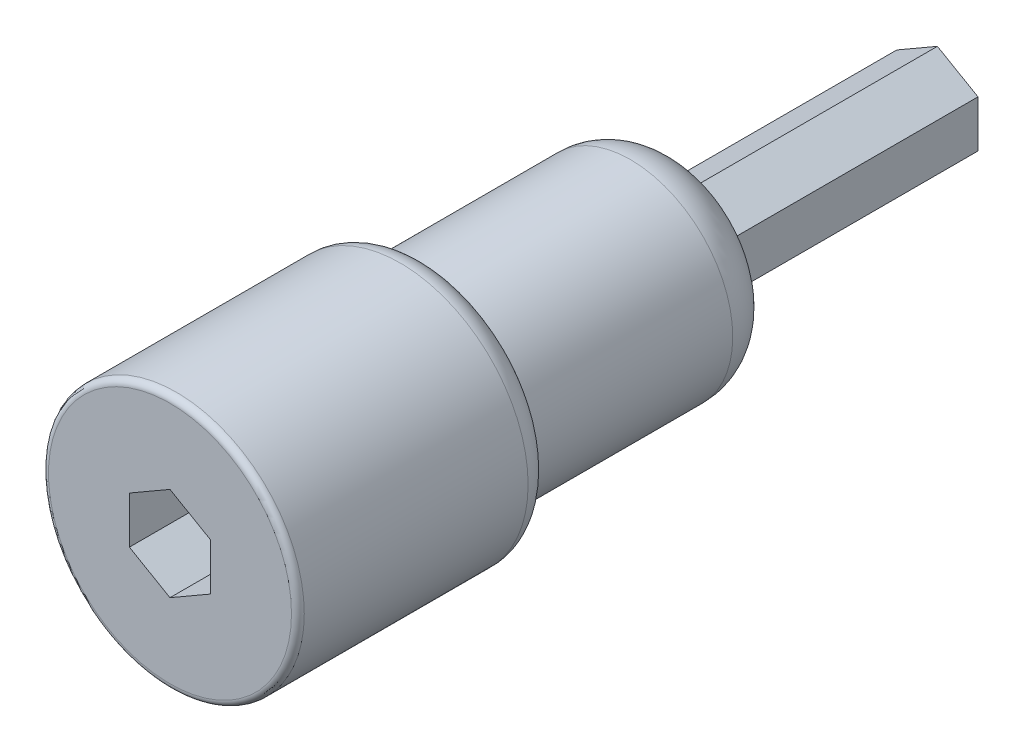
ISO-10303-21;
HEADER;
FILE_DESCRIPTION(('STEP AP214'),'2;1');
FILE_NAME('part.step','',(''),(''),'','','');
FILE_SCHEMA(('AUTOMOTIVE_DESIGN { 1 0 10303 214 1 1 1 1 }'));
ENDSEC;
DATA;
#1=APPLICATION_CONTEXT('core data for automotive mechanical design processes');
#2=APPLICATION_PROTOCOL_DEFINITION('international standard','automotive_design',2000,#1);
#3=PRODUCT_CONTEXT('',#1,'mechanical');
#4=PRODUCT('Part','Part','',(#3));
#5=PRODUCT_RELATED_PRODUCT_CATEGORY('part','',(#4));
#6=PRODUCT_DEFINITION_FORMATION('','',#4);
#7=PRODUCT_DEFINITION_CONTEXT('part definition',#1,'design');
#8=PRODUCT_DEFINITION('design','',#6,#7);
#9=PRODUCT_DEFINITION_SHAPE('','',#8);
#10=(LENGTH_UNIT() NAMED_UNIT(*) SI_UNIT(.MILLI.,.METRE.));
#11=(NAMED_UNIT(*) PLANE_ANGLE_UNIT() SI_UNIT($,.RADIAN.));
#12=(NAMED_UNIT(*) SI_UNIT($,.STERADIAN.) SOLID_ANGLE_UNIT());
#13=UNCERTAINTY_MEASURE_WITH_UNIT(LENGTH_MEASURE(1.E-05),#10,'distance_accuracy_value','');
#14=(GEOMETRIC_REPRESENTATION_CONTEXT(3) GLOBAL_UNCERTAINTY_ASSIGNED_CONTEXT((#13)) GLOBAL_UNIT_ASSIGNED_CONTEXT((#10,
#11,#12)) REPRESENTATION_CONTEXT('',''));
#15=CARTESIAN_POINT('',(0.,0.,0.));
#16=DIRECTION('',(0.,0.,1.));
#17=DIRECTION('',(1.,0.,0.));
#18=AXIS2_PLACEMENT_3D('',#15,#16,#17);
#19=CARTESIAN_POINT('',(0.,0.,20.));
#20=DIRECTION('',(0.,0.,-1.));
#21=DIRECTION('',(-1.,0.,0.));
#22=AXIS2_PLACEMENT_3D('',#19,#20,#21);
#23=CYLINDRICAL_SURFACE('',#22,10.);
#24=CARTESIAN_POINT('',(0.,0.,2.));
#25=DIRECTION('',(0.,0.,1.));
#26=DIRECTION('',(1.,0.,0.));
#27=AXIS2_PLACEMENT_3D('',#24,#25,#26);
#28=CIRCLE('',#27,10.);
#29=CARTESIAN_POINT('',(10.,0.,2.));
#30=VERTEX_POINT('',#29);
#31=EDGE_CURVE('E195',#30,#30,#28,.T.);
#32=ORIENTED_EDGE('',*,*,#31,.T.);
#33=EDGE_LOOP('',(#32));
#34=FACE_BOUND('',#33,.T.);
#35=CARTESIAN_POINT('',(0.,0.,19.5));
#36=DIRECTION('',(0.,0.,1.));
#37=DIRECTION('',(1.,0.,0.));
#38=AXIS2_PLACEMENT_3D('',#35,#36,#37);
#39=CIRCLE('',#38,10.);
#40=CARTESIAN_POINT('',(10.,0.,19.5));
#41=VERTEX_POINT('',#40);
#42=EDGE_CURVE('E112',#41,#41,#39,.F.);
#43=ORIENTED_EDGE('',*,*,#42,.T.);
#44=EDGE_LOOP('',(#43));
#45=FACE_BOUND('',#44,.T.);
#46=ADVANCED_FACE('F16',(#34,#45),#23,.T.);
#47=CARTESIAN_POINT('',(0.,0.,20.));
#48=DIRECTION('',(0.,0.,1.));
#49=DIRECTION('',(1.,0.,0.));
#50=AXIS2_PLACEMENT_3D('',#47,#48,#49);
#51=PLANE('',#50);
#52=CARTESIAN_POINT('',(0.,0.,20.));
#53=DIRECTION('',(0.,0.,1.));
#54=DIRECTION('',(1.,0.,0.));
#55=AXIS2_PLACEMENT_3D('',#52,#53,#54);
#56=CIRCLE('',#55,9.5);
#57=CARTESIAN_POINT('',(9.5,0.,20.));
#58=VERTEX_POINT('',#57);
#59=EDGE_CURVE('E179',#58,#58,#56,.T.);
#60=ORIENTED_EDGE('',*,*,#59,.T.);
#61=EDGE_LOOP('',(#60));
#62=FACE_BOUND('',#61,.T.);
#63=DIRECTION('',(0.866025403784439,-0.5,0.));
#64=VECTOR('',#63,1.);
#65=CARTESIAN_POINT('',(-3.175,-1.83308710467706,20.));
#66=LINE('',#65,#64);
#67=CARTESIAN_POINT('',(-3.175,-1.83308710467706,20.));
#68=VERTEX_POINT('',#67);
#69=CARTESIAN_POINT('',(0.,-3.66617420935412,20.));
#70=VERTEX_POINT('',#69);
#71=EDGE_CURVE('E39',#68,#70,#66,.T.);
#72=ORIENTED_EDGE('',*,*,#71,.F.);
#73=DIRECTION('',(0.,-1.,0.));
#74=VECTOR('',#73,1.);
#75=CARTESIAN_POINT('',(-3.175,1.83308710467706,20.));
#76=LINE('',#75,#74);
#77=CARTESIAN_POINT('',(-3.175,1.83308710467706,20.));
#78=VERTEX_POINT('',#77);
#79=EDGE_CURVE('E146',#78,#68,#76,.T.);
#80=ORIENTED_EDGE('',*,*,#79,.F.);
#81=DIRECTION('',(-0.866025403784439,-0.5,0.));
#82=VECTOR('',#81,1.);
#83=CARTESIAN_POINT('',(0.,3.66617420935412,20.));
#84=LINE('',#83,#82);
#85=CARTESIAN_POINT('',(0.,3.66617420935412,20.));
#86=VERTEX_POINT('',#85);
#87=EDGE_CURVE('E172',#86,#78,#84,.T.);
#88=ORIENTED_EDGE('',*,*,#87,.F.);
#89=DIRECTION('',(-0.866025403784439,0.5,0.));
#90=VECTOR('',#89,1.);
#91=CARTESIAN_POINT('',(3.175,1.83308710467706,20.));
#92=LINE('',#91,#90);
#93=CARTESIAN_POINT('',(3.175,1.83308710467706,20.));
#94=VERTEX_POINT('',#93);
#95=EDGE_CURVE('E169',#94,#86,#92,.T.);
#96=ORIENTED_EDGE('',*,*,#95,.F.);
#97=DIRECTION('',(0.,1.,0.));
#98=VECTOR('',#97,1.);
#99=CARTESIAN_POINT('',(3.175,-1.83308710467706,20.));
#100=LINE('',#99,#98);
#101=CARTESIAN_POINT('',(3.175,-1.83308710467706,20.));
#102=VERTEX_POINT('',#101);
#103=EDGE_CURVE('E166',#102,#94,#100,.T.);
#104=ORIENTED_EDGE('',*,*,#103,.F.);
#105=DIRECTION('',(0.866025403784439,0.5,0.));
#106=VECTOR('',#105,1.);
#107=CARTESIAN_POINT('',(0.,-3.66617420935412,20.));
#108=LINE('',#107,#106);
#109=EDGE_CURVE('E163',#70,#102,#108,.T.);
#110=ORIENTED_EDGE('',*,*,#109,.F.);
#111=EDGE_LOOP('',(#72,#80,#88,#96,#104,#110));
#112=FACE_BOUND('',#111,.T.);
#113=ADVANCED_FACE('F213',(#62,#112),#51,.T.);
#114=CARTESIAN_POINT('',(-3.175,-1.83308710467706,10.));
#115=DIRECTION('',(-0.5,-0.866025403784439,0.));
#116=DIRECTION('',(0.866025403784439,-0.5,0.));
#117=AXIS2_PLACEMENT_3D('',#114,#115,#116);
#118=PLANE('',#117);
#119=ORIENTED_EDGE('',*,*,#71,.T.);
#120=DIRECTION('',(0.,0.,1.));
#121=VECTOR('',#120,1.);
#122=CARTESIAN_POINT('',(0.,-3.66617420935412,10.));
#123=LINE('',#122,#121);
#124=CARTESIAN_POINT('',(0.,-3.66617420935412,10.));
#125=VERTEX_POINT('',#124);
#126=EDGE_CURVE('E161',#125,#70,#123,.T.);
#127=ORIENTED_EDGE('',*,*,#126,.F.);
#128=DIRECTION('',(0.866025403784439,-0.5,0.));
#129=VECTOR('',#128,1.);
#130=CARTESIAN_POINT('',(-3.175,-1.83308710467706,10.));
#131=LINE('',#130,#129);
#132=CARTESIAN_POINT('',(-3.175,-1.83308710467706,10.));
#133=VERTEX_POINT('',#132);
#134=EDGE_CURVE('E142',#133,#125,#131,.T.);
#135=ORIENTED_EDGE('',*,*,#134,.F.);
#136=DIRECTION('',(0.,0.,1.));
#137=VECTOR('',#136,1.);
#138=CARTESIAN_POINT('',(-3.175,-1.83308710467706,10.));
#139=LINE('',#138,#137);
#140=EDGE_CURVE('E177',#133,#68,#139,.T.);
#141=ORIENTED_EDGE('',*,*,#140,.T.);
#142=EDGE_LOOP('',(#119,#127,#135,#141));
#143=FACE_BOUND('',#142,.T.);
#144=ADVANCED_FACE('F220',(#143),#118,.F.);
#145=CARTESIAN_POINT('',(-3.175,1.83308710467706,10.));
#146=DIRECTION('',(-1.,0.,0.));
#147=DIRECTION('',(0.,-1.,0.));
#148=AXIS2_PLACEMENT_3D('',#145,#146,#147);
#149=PLANE('',#148);
#150=ORIENTED_EDGE('',*,*,#79,.T.);
#151=ORIENTED_EDGE('',*,*,#140,.F.);
#152=DIRECTION('',(0.,-1.,0.));
#153=VECTOR('',#152,1.);
#154=CARTESIAN_POINT('',(-3.175,1.83308710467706,10.));
#155=LINE('',#154,#153);
#156=CARTESIAN_POINT('',(-3.175,1.83308710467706,10.));
#157=VERTEX_POINT('',#156);
#158=EDGE_CURVE('E158',#157,#133,#155,.T.);
#159=ORIENTED_EDGE('',*,*,#158,.F.);
#160=DIRECTION('',(0.,0.,1.));
#161=VECTOR('',#160,1.);
#162=CARTESIAN_POINT('',(-3.175,1.83308710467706,10.));
#163=LINE('',#162,#161);
#164=EDGE_CURVE('E180',#157,#78,#163,.T.);
#165=ORIENTED_EDGE('',*,*,#164,.T.);
#166=EDGE_LOOP('',(#150,#151,#159,#165));
#167=FACE_BOUND('',#166,.T.);
#168=ADVANCED_FACE('F256',(#167),#149,.F.);
#169=CARTESIAN_POINT('',(0.,3.66617420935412,10.));
#170=DIRECTION('',(-0.5,0.866025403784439,0.));
#171=DIRECTION('',(-0.866025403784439,-0.5,0.));
#172=AXIS2_PLACEMENT_3D('',#169,#170,#171);
#173=PLANE('',#172);
#174=ORIENTED_EDGE('',*,*,#87,.T.);
#175=ORIENTED_EDGE('',*,*,#164,.F.);
#176=DIRECTION('',(-0.866025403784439,-0.5,0.));
#177=VECTOR('',#176,1.);
#178=CARTESIAN_POINT('',(0.,3.66617420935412,10.));
#179=LINE('',#178,#177);
#180=CARTESIAN_POINT('',(0.,3.66617420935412,10.));
#181=VERTEX_POINT('',#180);
#182=EDGE_CURVE('E155',#181,#157,#179,.T.);
#183=ORIENTED_EDGE('',*,*,#182,.F.);
#184=DIRECTION('',(0.,0.,1.));
#185=VECTOR('',#184,1.);
#186=CARTESIAN_POINT('',(0.,3.66617420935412,10.));
#187=LINE('',#186,#185);
#188=EDGE_CURVE('E182',#181,#86,#187,.T.);
#189=ORIENTED_EDGE('',*,*,#188,.T.);
#190=EDGE_LOOP('',(#174,#175,#183,#189));
#191=FACE_BOUND('',#190,.T.);
#192=ADVANCED_FACE('F258',(#191),#173,.F.);
#193=CARTESIAN_POINT('',(3.175,1.83308710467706,10.));
#194=DIRECTION('',(0.5,0.866025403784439,0.));
#195=DIRECTION('',(-0.866025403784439,0.5,0.));
#196=AXIS2_PLACEMENT_3D('',#193,#194,#195);
#197=PLANE('',#196);
#198=ORIENTED_EDGE('',*,*,#95,.T.);
#199=ORIENTED_EDGE('',*,*,#188,.F.);
#200=DIRECTION('',(-0.866025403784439,0.5,0.));
#201=VECTOR('',#200,1.);
#202=CARTESIAN_POINT('',(3.175,1.83308710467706,10.));
#203=LINE('',#202,#201);
#204=CARTESIAN_POINT('',(3.175,1.83308710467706,10.));
#205=VERTEX_POINT('',#204);
#206=EDGE_CURVE('E152',#205,#181,#203,.T.);
#207=ORIENTED_EDGE('',*,*,#206,.F.);
#208=DIRECTION('',(0.,0.,1.));
#209=VECTOR('',#208,1.);
#210=CARTESIAN_POINT('',(3.175,1.83308710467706,10.));
#211=LINE('',#210,#209);
#212=EDGE_CURVE('E184',#205,#94,#211,.T.);
#213=ORIENTED_EDGE('',*,*,#212,.T.);
#214=EDGE_LOOP('',(#198,#199,#207,#213));
#215=FACE_BOUND('',#214,.T.);
#216=ADVANCED_FACE('F260',(#215),#197,.F.);
#217=CARTESIAN_POINT('',(3.175,-1.83308710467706,10.));
#218=DIRECTION('',(1.,0.,0.));
#219=DIRECTION('',(0.,1.,0.));
#220=AXIS2_PLACEMENT_3D('',#217,#218,#219);
#221=PLANE('',#220);
#222=ORIENTED_EDGE('',*,*,#103,.T.);
#223=ORIENTED_EDGE('',*,*,#212,.F.);
#224=DIRECTION('',(0.,1.,0.));
#225=VECTOR('',#224,1.);
#226=CARTESIAN_POINT('',(3.175,-1.83308710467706,10.));
#227=LINE('',#226,#225);
#228=CARTESIAN_POINT('',(3.175,-1.83308710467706,10.));
#229=VERTEX_POINT('',#228);
#230=EDGE_CURVE('E149',#229,#205,#227,.T.);
#231=ORIENTED_EDGE('',*,*,#230,.F.);
#232=DIRECTION('',(0.,0.,1.));
#233=VECTOR('',#232,1.);
#234=CARTESIAN_POINT('',(3.175,-1.83308710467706,10.));
#235=LINE('',#234,#233);
#236=EDGE_CURVE('E186',#229,#102,#235,.T.);
#237=ORIENTED_EDGE('',*,*,#236,.T.);
#238=EDGE_LOOP('',(#222,#223,#231,#237));
#239=FACE_BOUND('',#238,.T.);
#240=ADVANCED_FACE('F263',(#239),#221,.F.);
#241=CARTESIAN_POINT('',(0.,-3.66617420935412,10.));
#242=DIRECTION('',(0.5,-0.866025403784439,0.));
#243=DIRECTION('',(0.866025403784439,0.5,0.));
#244=AXIS2_PLACEMENT_3D('',#241,#242,#243);
#245=PLANE('',#244);
#246=ORIENTED_EDGE('',*,*,#109,.T.);
#247=ORIENTED_EDGE('',*,*,#236,.F.);
#248=DIRECTION('',(0.866025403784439,0.5,0.));
#249=VECTOR('',#248,1.);
#250=CARTESIAN_POINT('',(0.,-3.66617420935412,10.));
#251=LINE('',#250,#249);
#252=EDGE_CURVE('E145',#125,#229,#251,.T.);
#253=ORIENTED_EDGE('',*,*,#252,.F.);
#254=ORIENTED_EDGE('',*,*,#126,.T.);
#255=EDGE_LOOP('',(#246,#247,#253,#254));
#256=FACE_BOUND('',#255,.T.);
#257=ADVANCED_FACE('F237',(#256),#245,.F.);
#258=CARTESIAN_POINT('',(0.,0.,10.));
#259=DIRECTION('',(0.,0.,1.));
#260=DIRECTION('',(1.,0.,0.));
#261=AXIS2_PLACEMENT_3D('',#258,#259,#260);
#262=PLANE('',#261);
#263=ORIENTED_EDGE('',*,*,#134,.T.);
#264=ORIENTED_EDGE('',*,*,#252,.T.);
#265=ORIENTED_EDGE('',*,*,#230,.T.);
#266=ORIENTED_EDGE('',*,*,#206,.T.);
#267=ORIENTED_EDGE('',*,*,#182,.T.);
#268=ORIENTED_EDGE('',*,*,#158,.T.);
#269=EDGE_LOOP('',(#263,#264,#265,#266,#267,#268));
#270=FACE_BOUND('',#269,.T.);
#271=ADVANCED_FACE('F228',(#270),#262,.T.);
#272=CARTESIAN_POINT('',(0.,0.,19.5));
#273=DIRECTION('',(0.,0.,1.));
#274=DIRECTION('',(1.,0.,0.));
#275=AXIS2_PLACEMENT_3D('',#272,#273,#274);
#276=TOROIDAL_SURFACE('',#275,9.5,0.5);
#277=ORIENTED_EDGE('',*,*,#42,.F.);
#278=EDGE_LOOP('',(#277));
#279=FACE_BOUND('',#278,.T.);
#280=ORIENTED_EDGE('',*,*,#59,.F.);
#281=EDGE_LOOP('',(#280));
#282=FACE_BOUND('',#281,.T.);
#283=ADVANCED_FACE('F226',(#279,#282),#276,.T.);
#284=CARTESIAN_POINT('',(0.,0.,-20.));
#285=DIRECTION('',(0.,0.,-1.));
#286=DIRECTION('',(-1.,0.,0.));
#287=AXIS2_PLACEMENT_3D('',#284,#285,#286);
#288=PLANE('',#287);
#289=CARTESIAN_POINT('',(0.,0.,-20.));
#290=DIRECTION('',(0.,0.,-1.));
#291=DIRECTION('',(-1.,0.,0.));
#292=AXIS2_PLACEMENT_3D('',#289,#290,#291);
#293=CIRCLE('',#292,4.);
#294=CARTESIAN_POINT('',(-4.,0.,-20.));
#295=VERTEX_POINT('',#294);
#296=EDGE_CURVE('E24',#295,#295,#293,.T.);
#297=ORIENTED_EDGE('',*,*,#296,.T.);
#298=EDGE_LOOP('',(#297));
#299=FACE_BOUND('',#298,.T.);
#300=DIRECTION('',(0.866025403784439,0.5,0.));
#301=VECTOR('',#300,1.);
#302=CARTESIAN_POINT('',(-3.175,1.83308710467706,-20.));
#303=LINE('',#302,#301);
#304=CARTESIAN_POINT('',(-3.175,1.83308710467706,-20.));
#305=VERTEX_POINT('',#304);
#306=CARTESIAN_POINT('',(0.,3.66617420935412,-20.));
#307=VERTEX_POINT('',#306);
#308=EDGE_CURVE('E31',#305,#307,#303,.T.);
#309=ORIENTED_EDGE('',*,*,#308,.F.);
#310=DIRECTION('',(0.,1.,0.));
#311=VECTOR('',#310,1.);
#312=CARTESIAN_POINT('',(-3.175,-1.83308710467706,-20.));
#313=LINE('',#312,#311);
#314=CARTESIAN_POINT('',(-3.175,-1.83308710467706,-20.));
#315=VERTEX_POINT('',#314);
#316=EDGE_CURVE('E102',#315,#305,#313,.T.);
#317=ORIENTED_EDGE('',*,*,#316,.F.);
#318=DIRECTION('',(-0.866025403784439,0.5,0.));
#319=VECTOR('',#318,1.);
#320=CARTESIAN_POINT('',(0.,-3.66617420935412,-20.));
#321=LINE('',#320,#319);
#322=CARTESIAN_POINT('',(0.,-3.66617420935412,-20.));
#323=VERTEX_POINT('',#322);
#324=EDGE_CURVE('E105',#323,#315,#321,.T.);
#325=ORIENTED_EDGE('',*,*,#324,.F.);
#326=DIRECTION('',(-0.866025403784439,-0.5,0.));
#327=VECTOR('',#326,1.);
#328=CARTESIAN_POINT('',(3.175,-1.83308710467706,-20.));
#329=LINE('',#328,#327);
#330=CARTESIAN_POINT('',(3.175,-1.83308710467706,-20.));
#331=VERTEX_POINT('',#330);
#332=EDGE_CURVE('E123',#331,#323,#329,.T.);
#333=ORIENTED_EDGE('',*,*,#332,.F.);
#334=DIRECTION('',(0.,-1.,0.));
#335=VECTOR('',#334,1.);
#336=CARTESIAN_POINT('',(3.175,1.83308710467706,-20.));
#337=LINE('',#336,#335);
#338=CARTESIAN_POINT('',(3.175,1.83308710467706,-20.));
#339=VERTEX_POINT('',#338);
#340=EDGE_CURVE('E450',#339,#331,#337,.T.);
#341=ORIENTED_EDGE('',*,*,#340,.F.);
#342=DIRECTION('',(0.866025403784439,-0.5,0.));
#343=VECTOR('',#342,1.);
#344=CARTESIAN_POINT('',(0.,3.66617420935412,-20.));
#345=LINE('',#344,#343);
#346=EDGE_CURVE('E437',#307,#339,#345,.T.);
#347=ORIENTED_EDGE('',*,*,#346,.F.);
#348=EDGE_LOOP('',(#309,#317,#325,#333,#341,#347));
#349=FACE_BOUND('',#348,.T.);
#350=ADVANCED_FACE('F104',(#299,#349),#288,.T.);
#351=CARTESIAN_POINT('',(0.,0.,-20.));
#352=DIRECTION('',(0.,0.,1.));
#353=DIRECTION('',(1.,0.,0.));
#354=AXIS2_PLACEMENT_3D('',#351,#352,#353);
#355=CYLINDRICAL_SURFACE('',#354,8.);
#356=CARTESIAN_POINT('',(0.,0.,-16.));
#357=DIRECTION('',(0.,0.,-1.));
#358=DIRECTION('',(-1.,0.,0.));
#359=AXIS2_PLACEMENT_3D('',#356,#357,#358);
#360=CIRCLE('',#359,8.);
#361=CARTESIAN_POINT('',(-8.,0.,-16.));
#362=VERTEX_POINT('',#361);
#363=EDGE_CURVE('E11',#362,#362,#360,.F.);
#364=ORIENTED_EDGE('',*,*,#363,.T.);
#365=EDGE_LOOP('',(#364));
#366=FACE_BOUND('',#365,.T.);
#367=CARTESIAN_POINT('',(0.,0.,0.));
#368=DIRECTION('',(0.,0.,1.));
#369=DIRECTION('',(1.,0.,0.));
#370=AXIS2_PLACEMENT_3D('',#367,#368,#369);
#371=CIRCLE('',#370,8.);
#372=CARTESIAN_POINT('',(8.,0.,0.));
#373=VERTEX_POINT('',#372);
#374=EDGE_CURVE('E111',#373,#373,#371,.F.);
#375=ORIENTED_EDGE('',*,*,#374,.T.);
#376=EDGE_LOOP('',(#375));
#377=FACE_BOUND('',#376,.T.);
#378=ADVANCED_FACE('F235',(#366,#377),#355,.T.);
#379=CARTESIAN_POINT('',(0.,0.,-40.));
#380=DIRECTION('',(0.,0.,-1.));
#381=DIRECTION('',(-1.,0.,0.));
#382=AXIS2_PLACEMENT_3D('',#379,#380,#381);
#383=PLANE('',#382);
#384=DIRECTION('',(0.866025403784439,0.5,0.));
#385=VECTOR('',#384,1.);
#386=CARTESIAN_POINT('',(-3.175,1.83308710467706,-40.));
#387=LINE('',#386,#385);
#388=CARTESIAN_POINT('',(-3.175,1.83308710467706,-40.));
#389=VERTEX_POINT('',#388);
#390=CARTESIAN_POINT('',(0.,3.66617420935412,-40.));
#391=VERTEX_POINT('',#390);
#392=EDGE_CURVE('E431',#389,#391,#387,.T.);
#393=ORIENTED_EDGE('',*,*,#392,.T.);
#394=DIRECTION('',(0.866025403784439,-0.5,0.));
#395=VECTOR('',#394,1.);
#396=CARTESIAN_POINT('',(0.,3.66617420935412,-40.));
#397=LINE('',#396,#395);
#398=CARTESIAN_POINT('',(3.175,1.83308710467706,-40.));
#399=VERTEX_POINT('',#398);
#400=EDGE_CURVE('E433',#391,#399,#397,.T.);
#401=ORIENTED_EDGE('',*,*,#400,.T.);
#402=DIRECTION('',(0.,-1.,0.));
#403=VECTOR('',#402,1.);
#404=CARTESIAN_POINT('',(3.175,1.83308710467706,-40.));
#405=LINE('',#404,#403);
#406=CARTESIAN_POINT('',(3.175,-1.83308710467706,-40.));
#407=VERTEX_POINT('',#406);
#408=EDGE_CURVE('E439',#399,#407,#405,.T.);
#409=ORIENTED_EDGE('',*,*,#408,.T.);
#410=DIRECTION('',(-0.866025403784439,-0.5,0.));
#411=VECTOR('',#410,1.);
#412=CARTESIAN_POINT('',(3.175,-1.83308710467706,-40.));
#413=LINE('',#412,#411);
#414=CARTESIAN_POINT('',(0.,-3.66617420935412,-40.));
#415=VERTEX_POINT('',#414);
#416=EDGE_CURVE('E441',#407,#415,#413,.T.);
#417=ORIENTED_EDGE('',*,*,#416,.T.);
#418=DIRECTION('',(-0.866025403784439,0.5,0.));
#419=VECTOR('',#418,1.);
#420=CARTESIAN_POINT('',(0.,-3.66617420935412,-40.));
#421=LINE('',#420,#419);
#422=CARTESIAN_POINT('',(-3.175,-1.83308710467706,-40.));
#423=VERTEX_POINT('',#422);
#424=EDGE_CURVE('E446',#415,#423,#421,.T.);
#425=ORIENTED_EDGE('',*,*,#424,.T.);
#426=DIRECTION('',(0.,1.,0.));
#427=VECTOR('',#426,1.);
#428=CARTESIAN_POINT('',(-3.175,-1.83308710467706,-40.));
#429=LINE('',#428,#427);
#430=EDGE_CURVE('E126',#423,#389,#429,.T.);
#431=ORIENTED_EDGE('',*,*,#430,.T.);
#432=EDGE_LOOP('',(#393,#401,#409,#417,#425,#431));
#433=FACE_BOUND('',#432,.T.);
#434=ADVANCED_FACE('F304',(#433),#383,.T.);
#435=CARTESIAN_POINT('',(-3.175,-1.83308710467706,-40.));
#436=DIRECTION('',(1.,0.,0.));
#437=DIRECTION('',(0.,1.,0.));
#438=AXIS2_PLACEMENT_3D('',#435,#436,#437);
#439=PLANE('',#438);
#440=DIRECTION('',(0.,0.,1.));
#441=VECTOR('',#440,1.);
#442=CARTESIAN_POINT('',(-3.175,-1.83308710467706,-40.));
#443=LINE('',#442,#441);
#444=EDGE_CURVE('E119',#423,#315,#443,.T.);
#445=ORIENTED_EDGE('',*,*,#444,.T.);
#446=ORIENTED_EDGE('',*,*,#316,.T.);
#447=DIRECTION('',(0.,0.,1.));
#448=VECTOR('',#447,1.);
#449=CARTESIAN_POINT('',(-3.175,1.83308710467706,-40.));
#450=LINE('',#449,#448);
#451=EDGE_CURVE('E127',#389,#305,#450,.T.);
#452=ORIENTED_EDGE('',*,*,#451,.F.);
#453=ORIENTED_EDGE('',*,*,#430,.F.);
#454=EDGE_LOOP('',(#445,#446,#452,#453));
#455=FACE_BOUND('',#454,.T.);
#456=ADVANCED_FACE('F125',(#455),#439,.F.);
#457=CARTESIAN_POINT('',(0.,-3.66617420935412,-40.));
#458=DIRECTION('',(0.5,0.866025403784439,0.));
#459=DIRECTION('',(-0.866025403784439,0.5,0.));
#460=AXIS2_PLACEMENT_3D('',#457,#458,#459);
#461=PLANE('',#460);
#462=DIRECTION('',(0.,0.,1.));
#463=VECTOR('',#462,1.);
#464=CARTESIAN_POINT('',(0.,-3.66617420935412,-40.));
#465=LINE('',#464,#463);
#466=EDGE_CURVE('E122',#415,#323,#465,.T.);
#467=ORIENTED_EDGE('',*,*,#466,.T.);
#468=ORIENTED_EDGE('',*,*,#324,.T.);
#469=ORIENTED_EDGE('',*,*,#444,.F.);
#470=ORIENTED_EDGE('',*,*,#424,.F.);
#471=EDGE_LOOP('',(#467,#468,#469,#470));
#472=FACE_BOUND('',#471,.T.);
#473=ADVANCED_FACE('F117',(#472),#461,.F.);
#474=CARTESIAN_POINT('',(3.175,-1.83308710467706,-40.));
#475=DIRECTION('',(-0.5,0.866025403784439,0.));
#476=DIRECTION('',(-0.866025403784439,-0.5,0.));
#477=AXIS2_PLACEMENT_3D('',#474,#475,#476);
#478=PLANE('',#477);
#479=DIRECTION('',(0.,0.,1.));
#480=VECTOR('',#479,1.);
#481=CARTESIAN_POINT('',(3.175,-1.83308710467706,-40.));
#482=LINE('',#481,#480);
#483=EDGE_CURVE('E129',#407,#331,#482,.T.);
#484=ORIENTED_EDGE('',*,*,#483,.T.);
#485=ORIENTED_EDGE('',*,*,#332,.T.);
#486=ORIENTED_EDGE('',*,*,#466,.F.);
#487=ORIENTED_EDGE('',*,*,#416,.F.);
#488=EDGE_LOOP('',(#484,#485,#486,#487));
#489=FACE_BOUND('',#488,.T.);
#490=ADVANCED_FACE('F295',(#489),#478,.F.);
#491=CARTESIAN_POINT('',(3.175,1.83308710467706,-40.));
#492=DIRECTION('',(-1.,0.,0.));
#493=DIRECTION('',(0.,0.,1.));
#494=AXIS2_PLACEMENT_3D('',#491,#492,#493);
#495=PLANE('',#494);
#496=DIRECTION('',(0.,0.,1.));
#497=VECTOR('',#496,1.);
#498=CARTESIAN_POINT('',(3.175,1.83308710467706,-40.));
#499=LINE('',#498,#497);
#500=EDGE_CURVE('E136',#399,#339,#499,.T.);
#501=ORIENTED_EDGE('',*,*,#500,.T.);
#502=ORIENTED_EDGE('',*,*,#340,.T.);
#503=ORIENTED_EDGE('',*,*,#483,.F.);
#504=ORIENTED_EDGE('',*,*,#408,.F.);
#505=EDGE_LOOP('',(#501,#502,#503,#504));
#506=FACE_BOUND('',#505,.T.);
#507=ADVANCED_FACE('F291',(#506),#495,.F.);
#508=CARTESIAN_POINT('',(0.,3.66617420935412,-40.));
#509=DIRECTION('',(-0.5,-0.866025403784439,0.));
#510=DIRECTION('',(0.866025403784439,-0.5,0.));
#511=AXIS2_PLACEMENT_3D('',#508,#509,#510);
#512=PLANE('',#511);
#513=DIRECTION('',(0.,0.,1.));
#514=VECTOR('',#513,1.);
#515=CARTESIAN_POINT('',(0.,3.66617420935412,-40.));
#516=LINE('',#515,#514);
#517=EDGE_CURVE('E139',#391,#307,#516,.T.);
#518=ORIENTED_EDGE('',*,*,#517,.T.);
#519=ORIENTED_EDGE('',*,*,#346,.T.);
#520=ORIENTED_EDGE('',*,*,#500,.F.);
#521=ORIENTED_EDGE('',*,*,#400,.F.);
#522=EDGE_LOOP('',(#518,#519,#520,#521));
#523=FACE_BOUND('',#522,.T.);
#524=ADVANCED_FACE('F287',(#523),#512,.F.);
#525=CARTESIAN_POINT('',(-3.175,1.83308710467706,-40.));
#526=DIRECTION('',(0.5,-0.866025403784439,0.));
#527=DIRECTION('',(0.866025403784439,0.5,0.));
#528=AXIS2_PLACEMENT_3D('',#525,#526,#527);
#529=PLANE('',#528);
#530=ORIENTED_EDGE('',*,*,#451,.T.);
#531=ORIENTED_EDGE('',*,*,#308,.T.);
#532=ORIENTED_EDGE('',*,*,#517,.F.);
#533=ORIENTED_EDGE('',*,*,#392,.F.);
#534=EDGE_LOOP('',(#530,#531,#532,#533));
#535=FACE_BOUND('',#534,.T.);
#536=ADVANCED_FACE('F209',(#535),#529,.F.);
#537=CARTESIAN_POINT('',(0.,0.,2.));
#538=DIRECTION('',(0.,0.,1.));
#539=DIRECTION('',(1.,0.,0.));
#540=AXIS2_PLACEMENT_3D('',#537,#538,#539);
#541=TOROIDAL_SURFACE('',#540,8.,2.);
#542=ORIENTED_EDGE('',*,*,#374,.F.);
#543=EDGE_LOOP('',(#542));
#544=FACE_BOUND('',#543,.T.);
#545=ORIENTED_EDGE('',*,*,#31,.F.);
#546=EDGE_LOOP('',(#545));
#547=FACE_BOUND('',#546,.T.);
#548=ADVANCED_FACE('F202',(#544,#547),#541,.T.);
#549=CARTESIAN_POINT('',(0.,0.,-16.));
#550=DIRECTION('',(0.,0.,-1.));
#551=DIRECTION('',(-1.,0.,0.));
#552=AXIS2_PLACEMENT_3D('',#549,#550,#551);
#553=DEGENERATE_TOROIDAL_SURFACE('',#552,4.,4.,.T.);
#554=ORIENTED_EDGE('',*,*,#363,.F.);
#555=EDGE_LOOP('',(#554));
#556=FACE_BOUND('',#555,.T.);
#557=ORIENTED_EDGE('',*,*,#296,.F.);
#558=EDGE_LOOP('',(#557));
#559=FACE_BOUND('',#558,.T.);
#560=ADVANCED_FACE('F18',(#556,#559),#553,.T.);
#561=CLOSED_SHELL('',(#46,#113,#144,#168,#192,#216,#240,#257,#271,#283,#350,#378,#434,#456,#473,
#490,#507,#524,#536,#548,#560));
#562=MANIFOLD_SOLID_BREP('B1',#561);
#563=ADVANCED_BREP_SHAPE_REPRESENTATION('',(#18,#562),#14);
#564=SHAPE_DEFINITION_REPRESENTATION(#9,#563);
ENDSEC;
END-ISO-10303-21;
